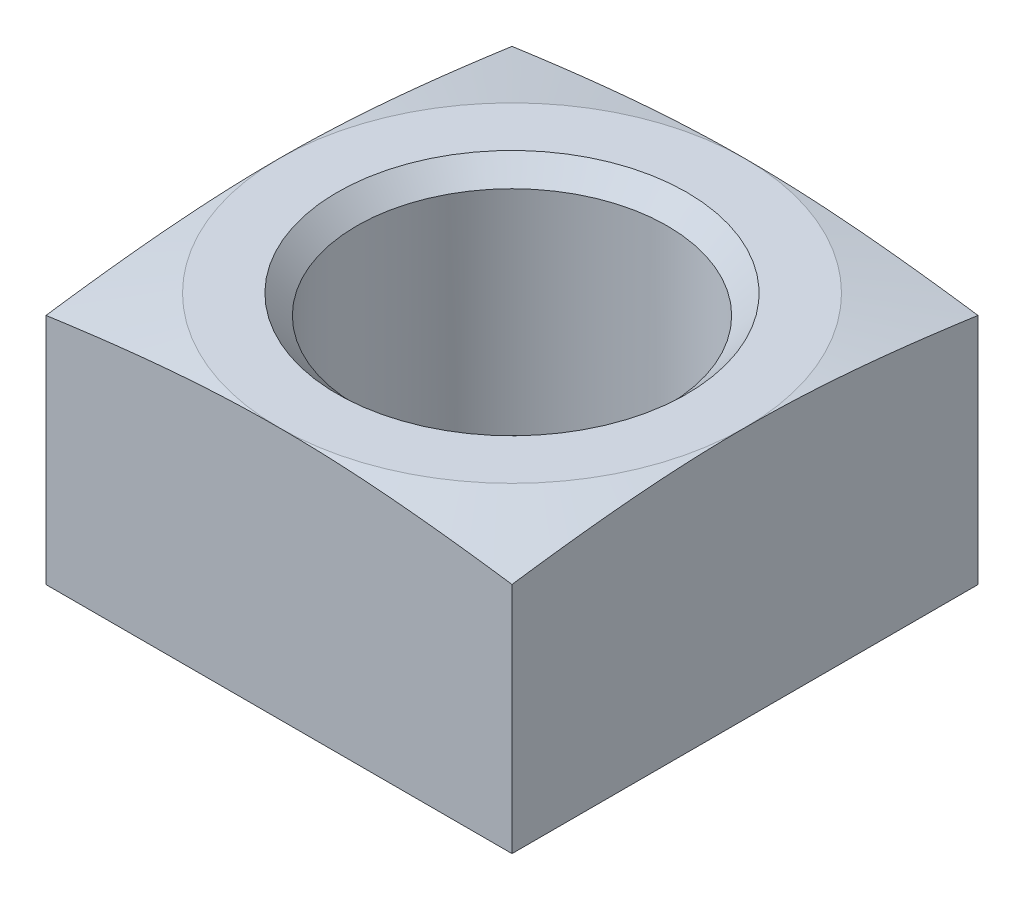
from build123d import *

# Parameters (mm, degrees)
SKETCH8_W           = 24
SKETCH8_H           = 13
BOSS_EXTRUDE2_DEPTH = 12
SKETCH11_R          = 8
CUT_EXTRUDE1_DEPTH  = 13
CHAMFER1_SIZE       = 1


with BuildPart() as part:
    # Sketch8 → Boss-Extrude2 (new, symmetric)
    with BuildSketch(Plane(origin=(0, 0, 0), x_dir=(0, 0, -1), z_dir=(1, 0, 0))):
        Rectangle(SKETCH8_W, SKETCH8_H)
    extrude(amount=BOSS_EXTRUDE2_DEPTH, both=True)

    # Sketch10 → Cut-Revolve1 (revolve, cut)
    with BuildSketch(Plane(origin=(0, 0, 0), x_dir=(0, 0, -1), z_dir=(1, 0, 0))):
        Polygon((-12, 6.5), (-17, 6.5), (-17, 5.5), align=None)
    revolve(axis=Axis((0, 59.838437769, 0), (0, -1, 0)), mode=Mode.SUBTRACT)

    # Sketch11 → Cut-Extrude1 (cut)
    with BuildSketch(Plane(origin=(0, 6.5, 0), x_dir=(1, 0, 0), z_dir=(0, 1, 0))):
        with Locations(Location((0, 0, 0), (0, 0, 270))):
            Circle(SKETCH11_R)
    extrude(amount=-CUT_EXTRUDE1_DEPTH, mode=Mode.SUBTRACT)

    # Chamfer1
    chamfer1_edges = [part.edges().sort_by_distance(p)[0] for p in [
        (0, 6.5, -8),
        (0, -6.5, -8),
    ]]
    chamfer(chamfer1_edges, length=CHAMFER1_SIZE)


solid = part.part
